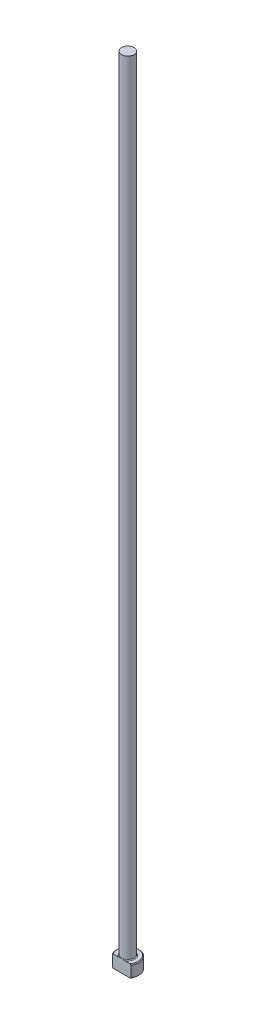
from build123d import *

# Parameters (mm, degrees)
CHAMFER1_SIZE = 0.254
FILLET1_R     = 0.254
KEY_DEPTH     = 255.050135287


with BuildPart() as part:
    # Sketch1 → Revolve1 (revolve)
    with BuildSketch(Plane.XY, mode=Mode.PRIVATE) as revolve1_sk:
        Polygon((0, 0), (-3.5687, 0), (-3.5687, 3.9624), (-1.98374, 3.9624), (-1.98374, 254), (0, 254), align=None)
    revolve(revolve1_sk.sketch.rotate(Axis((0, 259.958771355, 0), (0, -1, 0)), 270), axis=Axis((0, 259.958771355, 0), (0, -1, 0)))

    # Chamfer1
    chamfer1_edges = [part.edges().sort_by_distance(p)[0] for p in [
        (0, 3.9624, -3.5687),
        (0, 0, -3.5687),
    ]]
    chamfer(chamfer1_edges, length=CHAMFER1_SIZE)

    # Fillet1
    fillet1_edges = [part.edges().sort_by_distance(p)[0] for p in [
        (0, 3.9624, -1.98374),
    ]]
    fillet(fillet1_edges, radius=FILLET1_R)

    # Sketch2 → Key (cut, through all)
    with BuildSketch(Plane(origin=(0, 0, 0), x_dir=(1, 0, 0), z_dir=(0, 1, 0))):
        with BuildLine():
            Line((-2.966546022, -1.98374), (2.966546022, -1.98374))
            ThreePointArc((2.966546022, -1.98374), (0, -3.5687), (-2.966546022, -1.98374))
        make_face()
    extrude(amount=KEY_DEPTH, mode=Mode.SUBTRACT)


solid = part.part
